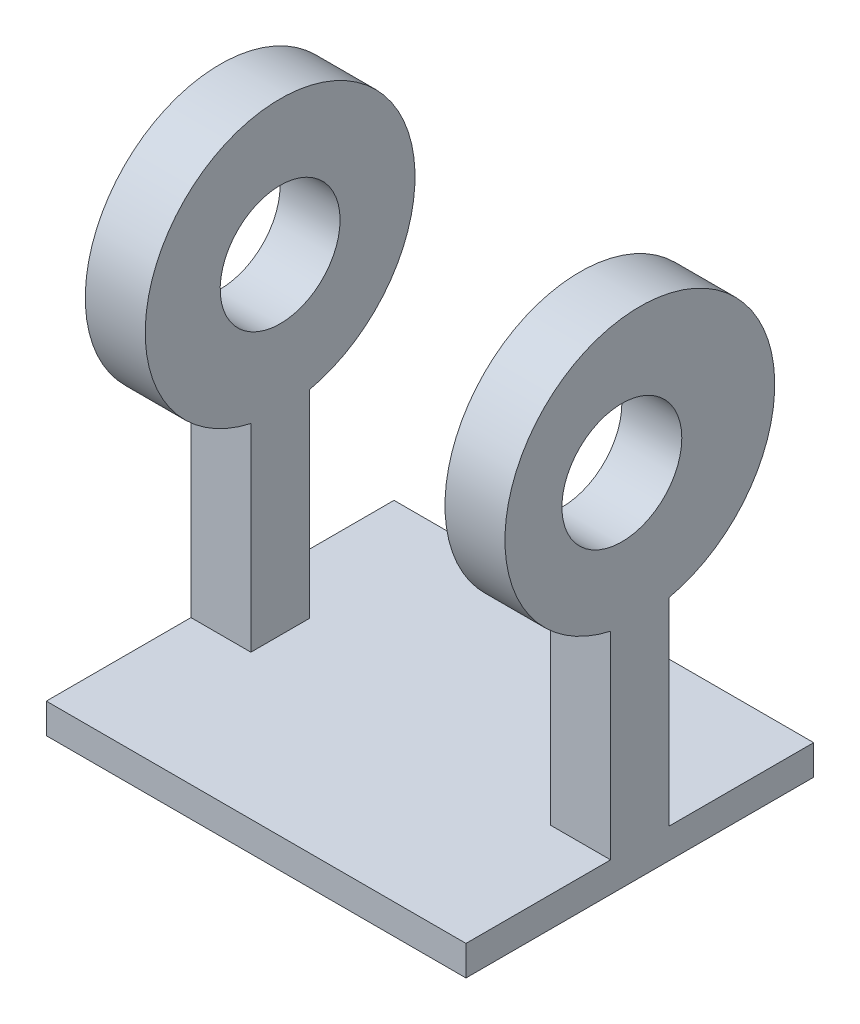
from build123d import *

# Parameters (mm, degrees)
BOSS_EXTRU_1_DEPTH      = 70
ESQUISSE4_R             = 22.5
ESQUISSE4_R_2           = 10
BOSS_EXTRU_2_DEPTH      = 70
ESQUISSE5_W             = 50
ESQUISSE5_H             = 77.5
ENL_V_MAT_EXTRU_3_DEPTH = 43
ESQUISSE8_W             = 50
ESQUISSE8_H             = 43.931053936
ENL_V_MAT_EXTRU_4_DEPTH = 43
ESQUISSE9_R             = 10
BOSS_EXTRU_3_DEPTH      = 10
ESQUISSE10_R            = 10
ENL_V_MAT_EXTRU_5_DEPTH = 10


with BuildPart() as part:
    # Esquisse3 → Boss.-Extru.1 (new body)
    with BuildSketch(Plane(origin=(0, 0, 0), x_dir=(0, 0, -1), z_dir=(1, 0, 0))):
        Polygon((0, 0), (24.125, 0), (24.125, -5), (-33.875, -5), (-33.875, 0), (-9.75, 0), (-9.75, 33.034473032), (0, 33.034473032), align=None)
    extrude(amount=BOSS_EXTRU_1_DEPTH)

    # Esquisse4 → Boss.-Extru.2 (add)
    with BuildSketch(Plane(origin=(70, 0, 0), x_dir=(0, 0, -1), z_dir=(1, 0, 0))):
        with Locations((-4.875, 55)):
            Circle(ESQUISSE4_R)
        with Locations((-4.875, 55)):
            Circle(ESQUISSE4_R_2, mode=Mode.SUBTRACT)
    extrude(amount=-BOSS_EXTRU_2_DEPTH)

    # Esquisse5 → Enl_v. mat.-Extru.3 (cut)
    with BuildSketch(Plane.XY.offset(9.75)):
        with Locations((35, 38.75)):
            Rectangle(ESQUISSE5_W, ESQUISSE5_H)
    extrude(amount=-ENL_V_MAT_EXTRU_3_DEPTH, mode=Mode.SUBTRACT)

    # Esquisse8 → Enl_v. mat.-Extru.4 (cut)
    with BuildSketch(Plane(origin=(0, 0, 9.75), x_dir=(-1, 0, 0), z_dir=(0, 0, -1))):
        with Locations((-35, 55)):
            Rectangle(ESQUISSE8_W, ESQUISSE8_H)
    extrude(amount=-ENL_V_MAT_EXTRU_4_DEPTH, mode=Mode.SUBTRACT)

    # Esquisse9 → Boss.-Extru.3 (add)
    with BuildSketch(Plane(origin=(70, 0, 0), x_dir=(0, 0, -1), z_dir=(1, 0, 0))):
        with Locations((-4.875, 55)):
            Circle(ESQUISSE9_R)
    extrude(amount=-BOSS_EXTRU_3_DEPTH)

    # Esquisse10 → Enl_v. mat.-Extru.5 (cut)
    with BuildSketch(Plane(origin=(70, 0, 0), x_dir=(0, 0, -1), z_dir=(1, 0, 0))):
        with Locations((-7.875, 55)):
            Circle(ESQUISSE10_R)
    extrude(amount=-ENL_V_MAT_EXTRU_5_DEPTH, mode=Mode.SUBTRACT)


solid = part.part
